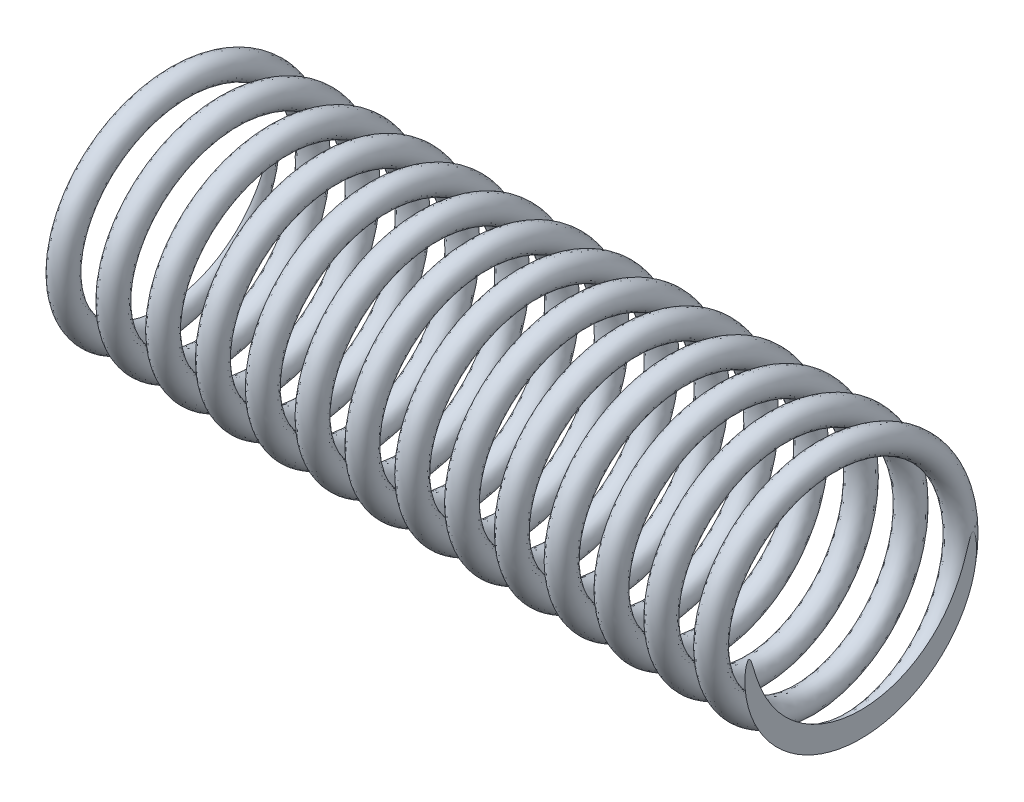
from build123d import *

# Parameters (mm, degrees)
RESSORT_PITCH       = 3.606666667
RESSORT_HEIGHT      = 54.1
RESSORT_RADIUS      = 8.1
RESSORT_START_ANGLE = -90
FIL_R               = 0.9
ESQUISSE3_W         = 4.05
ESQUISSE3_H         = 9.9


with BuildPart() as part:
    # Ressort: sweep along a helix
    with BuildLine() as ressort_path:
        add(Helix(RESSORT_PITCH, RESSORT_HEIGHT, RESSORT_RADIUS, center=(52.3, 0, 0), direction=(-1, 0, 0), lefthand=True, mode=Mode.PRIVATE).rotate(Axis((52.3, 0, 0), (-1, 0, 0)), RESSORT_START_ANGLE))
    # Fil → Ressort (sweep)
    with BuildSketch(Plane.XY):
        with Locations((52.3, 8.1)):
            Circle(FIL_R)
    sweep(path=ressort_path.line, is_frenet=True)

    # Esquisse3 → Enl_vement de mati_re-R_volution1 (revolve, cut)
    with BuildSketch(Plane.XY):
        with Locations((-2.025, 4.95)):
            Rectangle(ESQUISSE3_W, ESQUISSE3_H)
        with Locations((52.525, 4.95)):
            Rectangle(ESQUISSE3_W, ESQUISSE3_H)
    revolve(axis=Axis((0, 0, 0), (1, 0, 0)), mode=Mode.SUBTRACT)


solid = part.part
